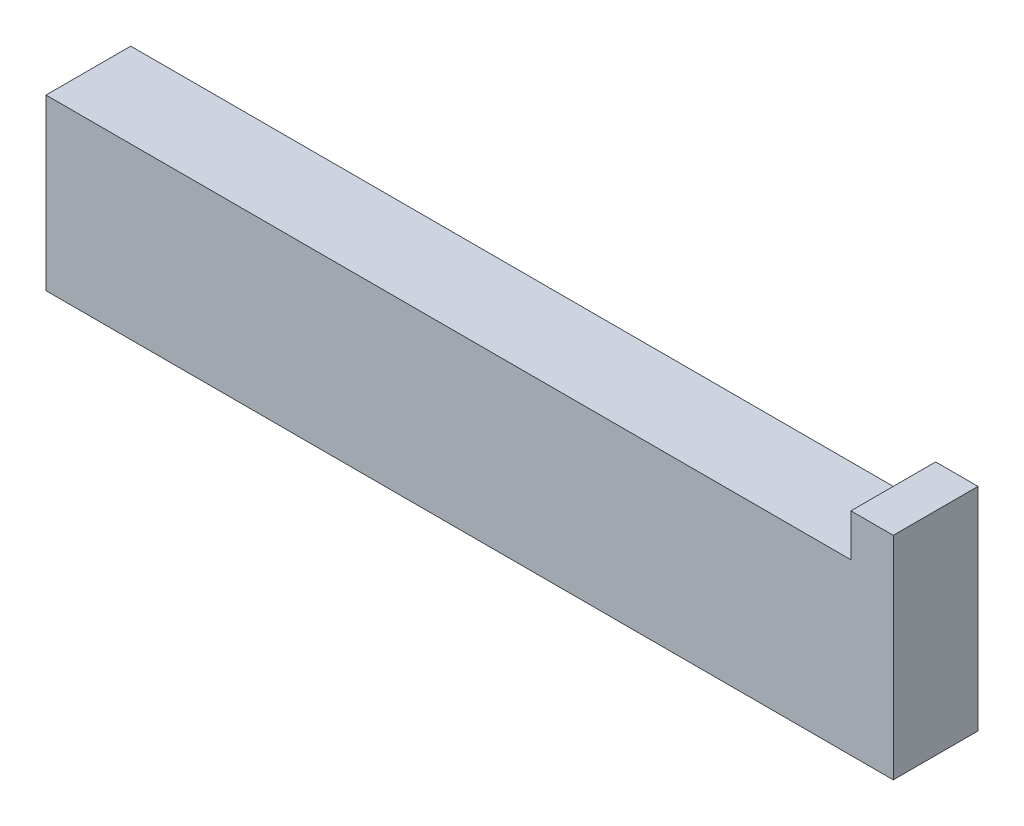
from build123d import *

# Parameters (mm, degrees)
SKIZZE1_W               = 200
SKIZZE1_H               = 40
LINEAR_AUSTRAGEN1_DEPTH = 20
SKIZZE2_W               = 10
SKIZZE2_H               = 20
LINEAR_AUSTRAGEN2_DEPTH = 10


with BuildPart() as part:
    # Skizze1 → Linear austragen1 (new body)
    with BuildSketch(Plane.XY):
        with Locations((29.291188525, -0.533606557)):
            Rectangle(SKIZZE1_W, SKIZZE1_H)
    extrude(amount=LINEAR_AUSTRAGEN1_DEPTH)

    # Skizze2 → Linear austragen2 (add)
    with BuildSketch(Plane(origin=(0, 19.466393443, 0), x_dir=(-1, 0, 0), z_dir=(0, 1, 0))):
        with Locations((-124.291188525, 10)):
            Rectangle(SKIZZE2_W, SKIZZE2_H)
    extrude(amount=LINEAR_AUSTRAGEN2_DEPTH)


solid = part.part
